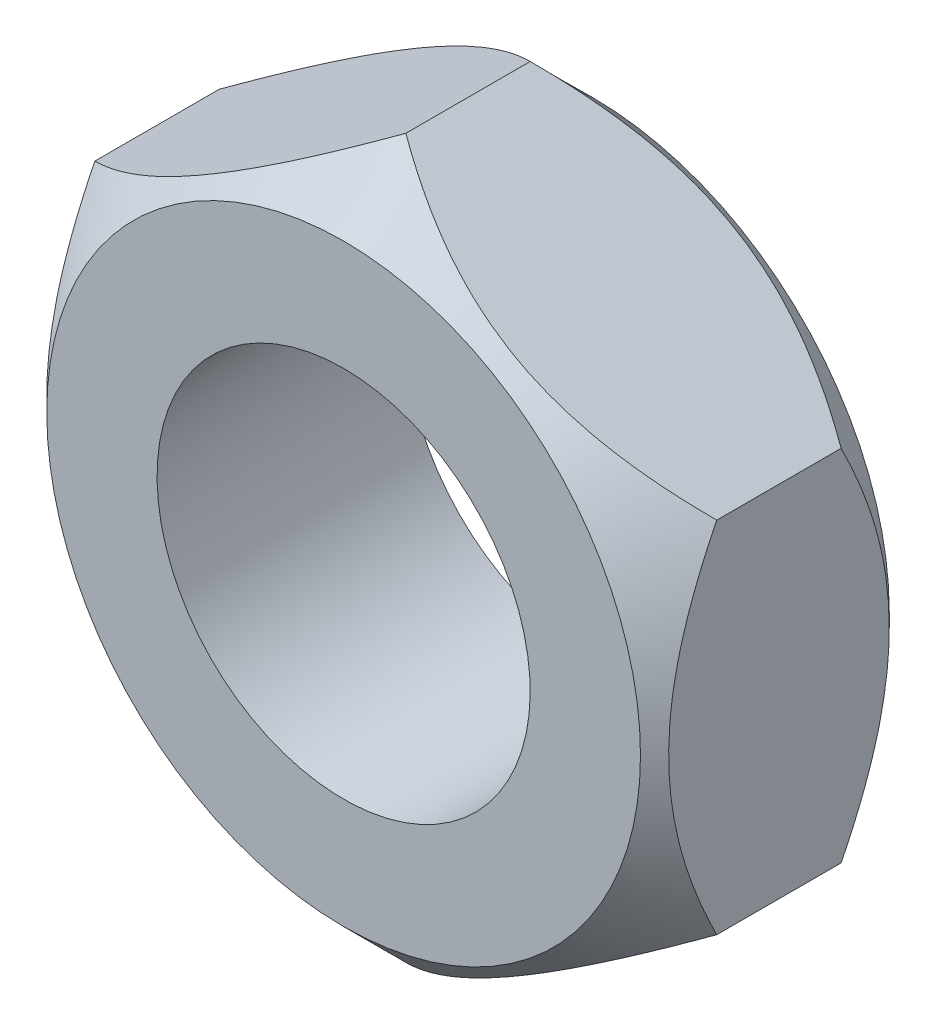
ISO-10303-21;
HEADER;
FILE_DESCRIPTION(('STEP AP214'),'2;1');
FILE_NAME('part.step','',(''),(''),'','','');
FILE_SCHEMA(('AUTOMOTIVE_DESIGN { 1 0 10303 214 1 1 1 1 }'));
ENDSEC;
DATA;
#1=APPLICATION_CONTEXT('core data for automotive mechanical design processes');
#2=APPLICATION_PROTOCOL_DEFINITION('international standard','automotive_design',2000,#1);
#3=PRODUCT_CONTEXT('',#1,'mechanical');
#4=PRODUCT('Part','Part','',(#3));
#5=PRODUCT_RELATED_PRODUCT_CATEGORY('part','',(#4));
#6=PRODUCT_DEFINITION_FORMATION('','',#4);
#7=PRODUCT_DEFINITION_CONTEXT('part definition',#1,'design');
#8=PRODUCT_DEFINITION('design','',#6,#7);
#9=PRODUCT_DEFINITION_SHAPE('','',#8);
#10=(LENGTH_UNIT() NAMED_UNIT(*) SI_UNIT(.MILLI.,.METRE.));
#11=(NAMED_UNIT(*) PLANE_ANGLE_UNIT() SI_UNIT($,.RADIAN.));
#12=(NAMED_UNIT(*) SI_UNIT($,.STERADIAN.) SOLID_ANGLE_UNIT());
#13=UNCERTAINTY_MEASURE_WITH_UNIT(LENGTH_MEASURE(1.E-05),#10,'distance_accuracy_value','');
#14=(GEOMETRIC_REPRESENTATION_CONTEXT(3) GLOBAL_UNCERTAINTY_ASSIGNED_CONTEXT((#13)) GLOBAL_UNIT_ASSIGNED_CONTEXT((#10,
#11,#12)) REPRESENTATION_CONTEXT('',''));
#15=CARTESIAN_POINT('',(0.,0.,0.));
#16=DIRECTION('',(0.,0.,1.));
#17=DIRECTION('',(1.,0.,0.));
#18=AXIS2_PLACEMENT_3D('',#15,#16,#17);
#19=CARTESIAN_POINT('',(89.089215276,333.149215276,-7.));
#20=DIRECTION('',(0.,0.,1.));
#21=DIRECTION('',(1.,0.,0.));
#22=AXIS2_PLACEMENT_3D('',#19,#20,#21);
#23=PLANE('',#22);
#24=CARTESIAN_POINT('',(93.92,337.98,-7.));
#25=DIRECTION('',(0.,0.,-1.));
#26=DIRECTION('',(0.,1.,0.));
#27=AXIS2_PLACEMENT_3D('',#24,#25,#26);
#28=CIRCLE('',#27,3.);
#29=CARTESIAN_POINT('',(93.92,340.98,-7.));
#30=VERTEX_POINT('',#29);
#31=EDGE_CURVE('E94',#30,#30,#28,.F.);
#32=ORIENTED_EDGE('',*,*,#31,.F.);
#33=EDGE_LOOP('',(#32));
#34=FACE_BOUND('',#33,.T.);
#35=CARTESIAN_POINT('',(93.92,337.98,-7.00000000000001));
#36=DIRECTION('',(0.,0.,-1.));
#37=DIRECTION('',(0.,1.,0.));
#38=AXIS2_PLACEMENT_3D('',#35,#36,#37);
#39=CIRCLE('',#38,4.77350269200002);
#40=CARTESIAN_POINT('',(93.92,342.753502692,-7.00000000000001));
#41=VERTEX_POINT('',#40);
#42=EDGE_CURVE('E102',#41,#41,#39,.F.);
#43=ORIENTED_EDGE('',*,*,#42,.T.);
#44=EDGE_LOOP('',(#43));
#45=FACE_BOUND('',#44,.T.);
#46=ADVANCED_FACE('F17',(#34,#45),#23,.T.);
#47=CARTESIAN_POINT('',(98.92,335.093248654,-10.827110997));
#48=DIRECTION('',(-0.500000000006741,0.866025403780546,0.));
#49=DIRECTION('',(-0.866025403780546,-0.500000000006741,0.));
#50=AXIS2_PLACEMENT_3D('',#47,#48,#49);
#51=PLANE('',#50);
#52=DIRECTION('',(0.,0.,1.));
#53=VECTOR('',#52,1.);
#54=CARTESIAN_POINT('',(98.92,335.093248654,-9.));
#55=LINE('',#54,#53);
#56=CARTESIAN_POINT('',(98.9200000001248,335.093248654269,-10.0000000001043));
#57=VERTEX_POINT('',#56);
#58=CARTESIAN_POINT('',(98.9200000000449,335.093248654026,-7.9999999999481));
#59=VERTEX_POINT('',#58);
#60=EDGE_CURVE('E78',#57,#59,#55,.T.);
#61=ORIENTED_EDGE('',*,*,#60,.T.);
#62=CARTESIAN_POINT('',(98.9200000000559,335.093248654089,-7.99999999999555));
#63=CARTESIAN_POINT('',(98.8340332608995,335.043615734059,-7.95037452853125));
#64=CARTESIAN_POINT('',(98.7474057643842,334.993601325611,-7.90227208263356));
#65=CARTESIAN_POINT('',(98.5726996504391,334.892734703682,-7.80957650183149));
#66=CARTESIAN_POINT('',(98.4846202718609,334.841882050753,-7.76498528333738));
#67=CARTESIAN_POINT('',(98.2171918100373,334.687482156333,-7.63679319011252));
#68=CARTESIAN_POINT('',(98.0355789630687,334.582627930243,-7.55932064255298));
#69=CARTESIAN_POINT('',(97.6693422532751,334.37118106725,-7.42665467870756));
#70=CARTESIAN_POINT('',(97.4848119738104,334.264642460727,-7.37112707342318));
#71=CARTESIAN_POINT('',(97.2049831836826,334.103083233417,-7.30689560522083));
#72=CARTESIAN_POINT('',(97.1112949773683,334.04899232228,-7.28867036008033));
#73=CARTESIAN_POINT('',(96.9231254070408,333.940352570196,-7.25898555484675));
#74=CARTESIAN_POINT('',(96.82864416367,333.885803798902,-7.24752498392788));
#75=CARTESIAN_POINT('',(96.5983981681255,333.752871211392,-7.22830918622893));
#76=CARTESIAN_POINT('',(96.4623853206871,333.674344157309,-7.22427791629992));
#77=CARTESIAN_POINT('',(96.190604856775,333.517431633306,-7.23104793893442));
#78=CARTESIAN_POINT('',(96.0548373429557,333.439046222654,-7.24185443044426));
#79=CARTESIAN_POINT('',(95.7845824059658,333.28301446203,-7.27766297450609));
#80=CARTESIAN_POINT('',(95.6500965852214,333.20536903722,-7.30268089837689));
#81=CARTESIAN_POINT('',(95.3834364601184,333.051412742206,-7.36555219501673));
#82=CARTESIAN_POINT('',(95.2512619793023,332.975101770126,-7.40340458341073));
#83=CARTESIAN_POINT('',(95.0166446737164,332.839645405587,-7.48127291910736));
#84=CARTESIAN_POINT('',(94.9136820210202,332.780199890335,-7.51923978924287));
#85=CARTESIAN_POINT('',(94.709604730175,332.662375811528,-7.60129088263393));
#86=CARTESIAN_POINT('',(94.6084901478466,332.603997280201,-7.64537529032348));
#87=CARTESIAN_POINT('',(94.4084275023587,332.488491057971,-7.73867347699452));
#88=CARTESIAN_POINT('',(94.3094737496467,332.431360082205,-7.78787112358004));
#89=CARTESIAN_POINT('',(94.1133982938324,332.318155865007,-7.89075008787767));
#90=CARTESIAN_POINT('',(94.016275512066,332.262082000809,-7.94442865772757));
#91=CARTESIAN_POINT('',(93.9200000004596,332.206497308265,-7.99999999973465));
#92=B_SPLINE_CURVE_WITH_KNOTS('',3,(#62,#63,#64,#65,#66,#67,#68,#69,#70,#71,#72,#73,#74,#75,#76,
#77,#78,#79,#80,#81,#82,#83,#84,#85,#86,#87,#88,#89,#90,#91),.UNSPECIFIED.,.F.,.F.,(4,2,2,2,2,2,
2,2,2,2,2,2,2,2,4),(0.,0.332918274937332,0.666017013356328,1.3358099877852,1.99496891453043,
2.32390206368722,2.65278604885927,3.12337124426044,3.59412136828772,4.06539826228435,
4.53663901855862,4.91088168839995,5.28513564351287,5.65824273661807,6.03112268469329),.UNSPECIFIED.);
#93=CARTESIAN_POINT('',(93.9200000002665,332.206497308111,-7.99999999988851));
#94=VERTEX_POINT('',#93);
#95=EDGE_CURVE('E21',#59,#94,#92,.T.);
#96=ORIENTED_EDGE('',*,*,#95,.T.);
#97=DIRECTION('',(0.,0.,-1.));
#98=VECTOR('',#97,1.);
#99=CARTESIAN_POINT('',(93.92,332.206497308,-9.));
#100=LINE('',#99,#98);
#101=CARTESIAN_POINT('',(93.919999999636,332.20649730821,-10.0000000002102));
#102=VERTEX_POINT('',#101);
#103=EDGE_CURVE('E112',#94,#102,#100,.T.);
#104=ORIENTED_EDGE('',*,*,#103,.T.);
#105=CARTESIAN_POINT('',(93.9199999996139,332.206497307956,-9.99999999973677));
#106=CARTESIAN_POINT('',(94.0059667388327,332.256130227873,-10.0496254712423));
#107=CARTESIAN_POINT('',(94.0925942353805,332.306144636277,-10.0977279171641));
#108=CARTESIAN_POINT('',(94.2673003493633,332.40701125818,-10.1904234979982));
#109=CARTESIAN_POINT('',(94.3553797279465,332.457863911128,-10.2350147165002));
#110=CARTESIAN_POINT('',(94.6228081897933,332.612263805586,-10.3632068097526));
#111=CARTESIAN_POINT('',(94.8044210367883,332.717118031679,-10.4406793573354));
#112=CARTESIAN_POINT('',(95.1706577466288,332.92856489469,-10.5733453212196));
#113=CARTESIAN_POINT('',(95.3551880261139,333.035103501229,-10.6288729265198));
#114=CARTESIAN_POINT('',(95.6350168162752,333.196662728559,-10.6931043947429));
#115=CARTESIAN_POINT('',(95.7287050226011,333.250753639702,-10.7113296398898));
#116=CARTESIAN_POINT('',(95.916874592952,333.359393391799,-10.7410144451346));
#117=CARTESIAN_POINT('',(96.0113558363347,333.413942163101,-10.7524750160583));
#118=CARTESIAN_POINT('',(96.2416018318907,333.546874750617,-10.7716908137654));
#119=CARTESIAN_POINT('',(96.3776146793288,333.6254018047,-10.7757220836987));
#120=CARTESIAN_POINT('',(96.6493951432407,333.782314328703,-10.7689520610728));
#121=CARTESIAN_POINT('',(96.78516265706,333.860699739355,-10.7581455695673));
#122=CARTESIAN_POINT('',(97.0554175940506,334.01673149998,-10.7223370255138));
#123=CARTESIAN_POINT('',(97.1899034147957,334.09437692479,-10.6973191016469));
#124=CARTESIAN_POINT('',(97.4565635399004,334.248333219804,-10.6344478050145));
#125=CARTESIAN_POINT('',(97.5887380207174,334.324644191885,-10.596595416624));
#126=CARTESIAN_POINT('',(97.8233553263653,334.46010055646,-10.518727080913));
#127=CARTESIAN_POINT('',(97.9263179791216,334.519546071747,-10.4807602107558));
#128=CARTESIAN_POINT('',(98.1303952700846,334.637370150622,-10.3987091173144));
#129=CARTESIAN_POINT('',(98.2315098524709,334.695748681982,-10.3546247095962));
#130=CARTESIAN_POINT('',(98.4315724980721,334.811254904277,-10.2613265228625));
#131=CARTESIAN_POINT('',(98.5305262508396,334.868385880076,-10.212128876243));
#132=CARTESIAN_POINT('',(98.7266017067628,334.981590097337,-10.1092499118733));
#133=CARTESIAN_POINT('',(98.8237244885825,335.037663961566,-10.0555713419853));
#134=CARTESIAN_POINT('',(98.9200000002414,335.093248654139,-9.99999999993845));
#135=B_SPLINE_CURVE_WITH_KNOTS('',3,(#105,#106,#107,#108,#109,#110,#111,#112,#113,#114,#115,
#116,#117,#118,#119,#120,#121,#122,#123,#124,#125,#126,#127,#128,#129,#130,#131,#132,#133,#134),
.UNSPECIFIED.,.F.,.F.,(4,2,2,2,2,2,2,2,2,2,2,2,2,2,4),(0.,0.332918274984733,0.666017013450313,
1.33580998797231,1.99496891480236,2.32390206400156,2.65278604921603,3.12337124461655,
3.59412136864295,4.06539826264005,4.53663901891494,4.91088168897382,5.28513564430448,
5.65824273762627,6.03112268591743),.UNSPECIFIED.);
#136=EDGE_CURVE('E92',#102,#57,#135,.T.);
#137=ORIENTED_EDGE('',*,*,#136,.T.);
#138=EDGE_LOOP('',(#61,#96,#104,#137));
#139=FACE_BOUND('',#138,.T.);
#140=ADVANCED_FACE('F89',(#139),#51,.F.);
#141=CARTESIAN_POINT('',(93.92,337.98,-7.));
#142=DIRECTION('',(0.,0.,-1.));
#143=DIRECTION('',(0.,1.,0.));
#144=AXIS2_PLACEMENT_3D('',#141,#142,#143);
#145=CONICAL_SURFACE('',#144,4.77350269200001,0.785398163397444);
#146=ORIENTED_EDGE('',*,*,#42,.F.);
#147=EDGE_LOOP('',(#146));
#148=FACE_BOUND('',#147,.T.);
#149=CARTESIAN_POINT('',(93.9199999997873,343.753502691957,-7.9999999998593));
#150=CARTESIAN_POINT('',(93.8340332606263,343.70386977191,-7.95037452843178));
#151=CARTESIAN_POINT('',(93.7474057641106,343.653855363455,-7.90227208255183));
#152=CARTESIAN_POINT('',(93.5726996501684,343.552988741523,-7.80957650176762));
#153=CARTESIAN_POINT('',(93.4846202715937,343.502136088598,-7.76498528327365));
#154=CARTESIAN_POINT('',(93.2171918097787,343.347736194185,-7.63679319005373));
#155=CARTESIAN_POINT('',(93.0355789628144,343.242881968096,-7.55932064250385));
#156=CARTESIAN_POINT('',(92.6693422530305,343.031435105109,-7.4266546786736));
#157=CARTESIAN_POINT('',(92.4848119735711,342.924896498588,-7.37112707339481));
#158=CARTESIAN_POINT('',(92.2049831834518,342.763337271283,-7.30689560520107));
#159=CARTESIAN_POINT('',(92.1112949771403,342.709246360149,-7.28867036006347));
#160=CARTESIAN_POINT('',(91.9231254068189,342.600606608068,-7.25898555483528));
#161=CARTESIAN_POINT('',(91.8286441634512,342.546057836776,-7.2475249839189));
#162=CARTESIAN_POINT('',(91.5983981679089,342.413125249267,-7.22830918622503));
#163=CARTESIAN_POINT('',(91.4623853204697,342.334598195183,-7.22427791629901));
#164=CARTESIAN_POINT('',(91.1906048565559,342.177685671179,-7.2310479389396));
#165=CARTESIAN_POINT('',(91.0548373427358,342.099300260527,-7.24185443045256));
#166=CARTESIAN_POINT('',(90.7845824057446,341.943268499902,-7.27766297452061));
#167=CARTESIAN_POINT('',(90.6500965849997,341.865623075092,-7.30268089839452));
#168=CARTESIAN_POINT('',(90.3834364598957,341.711666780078,-7.3655521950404));
#169=CARTESIAN_POINT('',(90.2512619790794,341.635355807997,-7.40340458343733));
#170=CARTESIAN_POINT('',(90.0166446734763,341.499899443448,-7.48127291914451));
#171=CARTESIAN_POINT('',(89.9136820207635,341.440453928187,-7.5192397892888));
#172=CARTESIAN_POINT('',(89.7096047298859,341.322629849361,-7.6012908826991));
#173=CARTESIAN_POINT('',(89.6084901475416,341.264251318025,-7.64537529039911));
#174=CARTESIAN_POINT('',(89.4084275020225,341.148745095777,-7.73867347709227));
#175=CARTESIAN_POINT('',(89.3094737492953,341.091614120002,-7.78787112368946));
#176=CARTESIAN_POINT('',(89.113398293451,340.978409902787,-7.89075008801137));
#177=CARTESIAN_POINT('',(89.0162755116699,340.92233603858,-7.94442865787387));
#178=CARTESIAN_POINT('',(88.920000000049,340.866751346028,-7.99999999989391));
#179=B_SPLINE_CURVE_WITH_KNOTS('',3,(#149,#150,#151,#152,#153,#154,#155,#156,#157,#158,#159,
#160,#161,#162,#163,#164,#165,#166,#167,#168,#169,#170,#171,#172,#173,#174,#175,#176,#177,#178),
.UNSPECIFIED.,.F.,.F.,(4,2,2,2,2,2,2,2,2,2,2,2,2,2,4),(0.,0.332918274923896,0.666017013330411,
1.33580998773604,1.9949689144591,2.32390206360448,2.65278604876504,3.12337124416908,
3.59412136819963,4.06539826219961,4.53663901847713,4.91088168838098,5.28513564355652,
5.6582427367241,6.03112268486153),.UNSPECIFIED.);
#180=CARTESIAN_POINT('',(93.9200000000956,343.753502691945,-7.99999999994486));
#181=VERTEX_POINT('',#180);
#182=CARTESIAN_POINT('',(88.9200000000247,340.866751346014,-7.99999999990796));
#183=VERTEX_POINT('',#182);
#184=EDGE_CURVE('E193',#181,#183,#179,.T.);
#185=ORIENTED_EDGE('',*,*,#184,.T.);
#186=CARTESIAN_POINT('',(88.9199999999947,340.866751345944,-7.99999999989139));
#187=CARTESIAN_POINT('',(88.9199999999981,340.768134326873,-7.95069857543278));
#188=CARTESIAN_POINT('',(88.9199999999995,340.66876378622,-7.90290055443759));
#189=CARTESIAN_POINT('',(88.9200000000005,340.468369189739,-7.81076481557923));
#190=CARTESIAN_POINT('',(88.9200000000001,340.367344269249,-7.76642898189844));
#191=CARTESIAN_POINT('',(88.9199999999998,340.060508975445,-7.63886641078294));
#192=CARTESIAN_POINT('',(88.9200000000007,339.852117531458,-7.56168720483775));
#193=CARTESIAN_POINT('',(88.9199999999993,339.429264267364,-7.42845956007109));
#194=CARTESIAN_POINT('',(88.919999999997,339.214825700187,-7.37233960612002));
#195=CARTESIAN_POINT('',(88.9200000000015,338.889670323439,-7.30746295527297));
#196=CARTESIAN_POINT('',(88.9200000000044,338.780838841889,-7.28906547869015));
#197=CARTESIAN_POINT('',(88.9199999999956,338.562250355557,-7.2591228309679));
#198=CARTESIAN_POINT('',(88.9199999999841,338.452493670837,-7.24757538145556));
#199=CARTESIAN_POINT('',(88.9200000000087,338.282160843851,-7.23525702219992));
#200=CARTESIAN_POINT('',(88.9200000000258,338.22175700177,-7.23197445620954));
#201=CARTESIAN_POINT('',(88.9199999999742,338.100904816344,-7.22759417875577));
#202=CARTESIAN_POINT('',(88.9199999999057,338.040456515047,-7.22649528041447));
#203=CARTESIAN_POINT('',(88.9199999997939,337.828266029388,-7.22650239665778));
#204=CARTESIAN_POINT('',(88.9199999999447,337.676480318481,-7.23344234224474));
#205=CARTESIAN_POINT('',(88.9200000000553,337.374072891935,-7.26082178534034));
#206=CARTESIAN_POINT('',(88.9200000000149,337.223452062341,-7.28127069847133));
#207=CARTESIAN_POINT('',(88.9199999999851,336.923754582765,-7.33470670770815));
#208=CARTESIAN_POINT('',(88.919999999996,336.774688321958,-7.36775146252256));
#209=CARTESIAN_POINT('',(88.920000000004,336.479421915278,-7.44486859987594));
#210=CARTESIAN_POINT('',(88.9200000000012,336.333222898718,-7.48894523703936));
#211=CARTESIAN_POINT('',(88.9199999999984,335.999831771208,-7.60138894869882));
#212=CARTESIAN_POINT('',(88.9199999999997,335.813756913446,-7.67306329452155));
#213=CARTESIAN_POINT('',(88.9200000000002,335.539596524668,-7.78966277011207));
#214=CARTESIAN_POINT('',(88.9200000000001,335.449432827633,-7.82984151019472));
#215=CARTESIAN_POINT('',(88.9199999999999,335.270396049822,-7.91294466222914));
#216=CARTESIAN_POINT('',(88.9199999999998,335.181522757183,-7.95586861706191));
#217=CARTESIAN_POINT('',(88.92,335.093248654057,-7.99999999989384));
#218=B_SPLINE_CURVE_WITH_KNOTS('',3,(#186,#187,#188,#189,#190,#191,#192,#193,#194,#195,#196,
#197,#198,#199,#200,#201,#202,#203,#204,#205,#206,#207,#208,#209,#210,#211,#212,#213,#214,#215,
#216,#217),.UNSPECIFIED.,.F.,.F.,(4,2,2,2,2,2,2,2,2,2,2,2,2,2,2,4),(0.,0.330743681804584,
0.661666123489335,1.32747457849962,1.99100110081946,2.32194787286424,2.65278450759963,
2.83422741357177,3.01557167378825,3.47071012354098,3.9261661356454,4.38373257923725,
4.84147576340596,5.43902020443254,5.73511925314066,6.031169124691),.UNSPECIFIED.);
#219=CARTESIAN_POINT('',(88.9200000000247,335.093248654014,-7.99999999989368));
#220=VERTEX_POINT('',#219);
#221=EDGE_CURVE('E201',#183,#220,#218,.T.);
#222=ORIENTED_EDGE('',*,*,#221,.T.);
#223=CARTESIAN_POINT('',(88.9200000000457,335.093248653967,-7.99999999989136));
#224=CARTESIAN_POINT('',(89.0059667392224,335.043615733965,-7.95037452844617));
#225=CARTESIAN_POINT('',(89.0925942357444,334.99360132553,-7.90227208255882));
#226=CARTESIAN_POINT('',(89.2673003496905,334.892734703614,-7.80957650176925));
#227=CARTESIAN_POINT('',(89.355379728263,334.841882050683,-7.76498528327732));
#228=CARTESIAN_POINT('',(89.6228081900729,334.687482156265,-7.63679319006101));
#229=CARTESIAN_POINT('',(89.8044210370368,334.582627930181,-7.55932064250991));
#230=CARTESIAN_POINT('',(90.1706577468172,334.371181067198,-7.42665467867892));
#231=CARTESIAN_POINT('',(90.3551880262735,334.264642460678,-7.37112707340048));
#232=CARTESIAN_POINT('',(90.6350168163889,334.103083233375,-7.30689560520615));
#233=CARTESIAN_POINT('',(90.7287050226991,334.048992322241,-7.28867036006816));
#234=CARTESIAN_POINT('',(90.916874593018,333.940352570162,-7.25898555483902));
#235=CARTESIAN_POINT('',(91.0113558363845,333.88580379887,-7.24752498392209));
#236=CARTESIAN_POINT('',(91.2416018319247,333.752871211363,-7.22830918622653));
#237=CARTESIAN_POINT('',(91.3776146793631,333.67434415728,-7.22427791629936));
#238=CARTESIAN_POINT('',(91.6493951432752,333.517431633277,-7.23104793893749));
#239=CARTESIAN_POINT('',(91.7851626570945,333.439046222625,-7.24185443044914));
#240=CARTESIAN_POINT('',(92.0554175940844,333.283014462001,-7.27766297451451));
#241=CARTESIAN_POINT('',(92.1899034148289,333.205369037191,-7.30268089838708));
#242=CARTESIAN_POINT('',(92.4565635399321,333.051412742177,-7.36555219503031));
#243=CARTESIAN_POINT('',(92.5887380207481,332.975101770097,-7.40340458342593));
#244=CARTESIAN_POINT('',(92.8233553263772,332.839645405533,-7.48127291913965));
#245=CARTESIAN_POINT('',(92.9263179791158,332.780199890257,-7.51923978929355));
#246=CARTESIAN_POINT('',(93.1303952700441,332.662375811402,-7.60129088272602));
#247=CARTESIAN_POINT('',(93.2315098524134,332.603997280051,-7.64537529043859));
#248=CARTESIAN_POINT('',(93.4315724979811,332.488491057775,-7.73867347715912));
#249=CARTESIAN_POINT('',(93.5305262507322,332.431360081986,-7.7878711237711));
#250=CARTESIAN_POINT('',(93.7266017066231,332.318155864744,-7.89075008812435));
#251=CARTESIAN_POINT('',(93.8237244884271,332.262082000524,-7.94442865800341));
#252=CARTESIAN_POINT('',(93.9200000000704,332.206497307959,-8.00000000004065));
#253=B_SPLINE_CURVE_WITH_KNOTS('',3,(#223,#224,#225,#226,#227,#228,#229,#230,#231,#232,#233,
#234,#235,#236,#237,#238,#239,#240,#241,#242,#243,#244,#245,#246,#247,#248,#249,#250,#251,#252),
.UNSPECIFIED.,.F.,.F.,(4,2,2,2,2,2,2,2,2,2,2,2,2,2,4),(0.,0.332918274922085,0.666017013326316,
1.33580998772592,1.99496891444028,2.32390206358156,2.65278604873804,3.12337124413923,
3.59412136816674,4.06539826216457,4.53663901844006,4.91088168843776,5.28513564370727,
5.65824273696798,6.03112268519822),.UNSPECIFIED.);
#254=EDGE_CURVE('E99',#220,#94,#253,.T.);
#255=ORIENTED_EDGE('',*,*,#254,.T.);
#256=ORIENTED_EDGE('',*,*,#95,.F.);
#257=CARTESIAN_POINT('',(98.92,335.09324865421,-7.99999999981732));
#258=CARTESIAN_POINT('',(98.9199999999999,335.191865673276,-7.9506985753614));
#259=CARTESIAN_POINT('',(98.92,335.291236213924,-7.90290055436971));
#260=CARTESIAN_POINT('',(98.92,335.491630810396,-7.81076481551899));
#261=CARTESIAN_POINT('',(98.9200000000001,335.592655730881,-7.76642898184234));
#262=CARTESIAN_POINT('',(98.9199999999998,335.89949102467,-7.63886641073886));
#263=CARTESIAN_POINT('',(98.9199999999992,336.107882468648,-7.56168720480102));
#264=CARTESIAN_POINT('',(98.9200000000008,336.53073573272,-7.4284595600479));
#265=CARTESIAN_POINT('',(98.9200000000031,336.745174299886,-7.37233960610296));
#266=CARTESIAN_POINT('',(98.9199999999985,337.070329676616,-7.30746295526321));
#267=CARTESIAN_POINT('',(98.9199999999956,337.17916115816,-7.2890654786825));
#268=CARTESIAN_POINT('',(98.9200000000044,337.39774964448,-7.25912283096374));
#269=CARTESIAN_POINT('',(98.920000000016,337.507506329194,-7.24757538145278));
#270=CARTESIAN_POINT('',(98.9199999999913,337.677839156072,-7.23525702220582));
#271=CARTESIAN_POINT('',(98.9199999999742,337.73824299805,-7.23197445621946));
#272=CARTESIAN_POINT('',(98.9200000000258,337.859095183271,-7.22759417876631));
#273=CARTESIAN_POINT('',(98.9200000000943,337.919543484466,-7.22649528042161));
#274=CARTESIAN_POINT('',(98.9200000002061,338.131733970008,-7.22650239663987));
#275=CARTESIAN_POINT('',(98.9200000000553,338.283519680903,-7.23344234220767));
#276=CARTESIAN_POINT('',(98.9199999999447,338.585927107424,-7.26082178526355));
#277=CARTESIAN_POINT('',(98.9199999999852,338.736547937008,-7.281270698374));
#278=CARTESIAN_POINT('',(98.9200000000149,339.036245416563,-7.33470670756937));
#279=CARTESIAN_POINT('',(98.920000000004,339.18531167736,-7.36775146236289));
#280=CARTESIAN_POINT('',(98.919999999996,339.480578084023,-7.44486859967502));
#281=CARTESIAN_POINT('',(98.9199999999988,339.626777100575,-7.48894523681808));
#282=CARTESIAN_POINT('',(98.9200000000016,339.960168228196,-7.60138894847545));
#283=CARTESIAN_POINT('',(98.9200000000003,340.146243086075,-7.67306329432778));
#284=CARTESIAN_POINT('',(98.9199999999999,340.420403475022,-7.78966276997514));
#285=CARTESIAN_POINT('',(98.9199999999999,340.510567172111,-7.82984151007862));
#286=CARTESIAN_POINT('',(98.9200000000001,340.68960395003,-7.91294466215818));
#287=CARTESIAN_POINT('',(98.9200000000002,340.778477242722,-7.95586861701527));
#288=CARTESIAN_POINT('',(98.92,340.866751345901,-7.99999999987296));
#289=B_SPLINE_CURVE_WITH_KNOTS('',3,(#257,#258,#259,#260,#261,#262,#263,#264,#265,#266,#267,
#268,#269,#270,#271,#272,#273,#274,#275,#276,#277,#278,#279,#280,#281,#282,#283,#284,#285,#286,
#287,#288),.UNSPECIFIED.,.F.,.F.,(4,2,2,2,2,2,2,2,2,2,2,2,2,2,2,4),(0.,0.330743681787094,
0.661666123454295,1.32747457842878,1.99100110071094,2.32194787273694,2.65278450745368,
2.83422741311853,3.01557167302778,3.47071012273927,3.92616613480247,4.38373257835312,
4.84147576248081,5.4390202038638,5.73511925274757,6.03116912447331),.UNSPECIFIED.);
#290=CARTESIAN_POINT('',(98.92,340.866751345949,-7.99999999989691));
#291=VERTEX_POINT('',#290);
#292=EDGE_CURVE('E75',#59,#291,#289,.T.);
#293=ORIENTED_EDGE('',*,*,#292,.T.);
#294=CARTESIAN_POINT('',(98.919999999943,340.866751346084,-7.99999999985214));
#295=CARTESIAN_POINT('',(98.8340332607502,340.916384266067,-7.95037452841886));
#296=CARTESIAN_POINT('',(98.7474057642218,340.966398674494,-7.90227208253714));
#297=CARTESIAN_POINT('',(98.5726996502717,341.067265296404,-7.809576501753));
#298=CARTESIAN_POINT('',(98.4846202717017,341.118117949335,-7.76498528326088));
#299=CARTESIAN_POINT('',(98.2171918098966,341.272517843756,-7.63679319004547));
#300=CARTESIAN_POINT('',(98.0355789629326,341.377372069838,-7.55932064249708));
#301=CARTESIAN_POINT('',(97.6693422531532,341.588818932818,-7.42665467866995));
#302=CARTESIAN_POINT('',(97.4848119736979,341.695357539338,-7.37112707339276));
#303=CARTESIAN_POINT('',(97.2049831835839,341.85691676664,-7.30689560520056));
#304=CARTESIAN_POINT('',(97.1112949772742,341.911007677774,-7.28867036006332));
#305=CARTESIAN_POINT('',(96.9231254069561,342.019647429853,-7.25898555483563));
#306=CARTESIAN_POINT('',(96.8286441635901,342.074196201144,-7.24752498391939));
#307=CARTESIAN_POINT('',(96.5983981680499,342.207128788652,-7.22830918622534));
#308=CARTESIAN_POINT('',(96.462385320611,342.285655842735,-7.2242779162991));
#309=CARTESIAN_POINT('',(96.1906048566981,342.442568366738,-7.23104793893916));
#310=CARTESIAN_POINT('',(96.0548373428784,342.520953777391,-7.24185443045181));
#311=CARTESIAN_POINT('',(95.7845824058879,342.676985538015,-7.27766297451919));
#312=CARTESIAN_POINT('',(95.6500965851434,342.754630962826,-7.30268089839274));
#313=CARTESIAN_POINT('',(95.38343646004,342.908587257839,-7.36555219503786));
#314=CARTESIAN_POINT('',(95.251261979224,342.984898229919,-7.40340458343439));
#315=CARTESIAN_POINT('',(95.0166446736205,343.120354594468,-7.48127291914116));
#316=CARTESIAN_POINT('',(94.913682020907,343.17980010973,-7.5192397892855));
#317=CARTESIAN_POINT('',(94.7096047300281,343.297624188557,-7.60129088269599));
#318=CARTESIAN_POINT('',(94.6084901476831,343.356002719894,-7.64537529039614));
#319=CARTESIAN_POINT('',(94.4084275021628,343.471508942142,-7.73867347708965));
#320=CARTESIAN_POINT('',(94.3094737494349,343.528639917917,-7.78787112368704));
#321=CARTESIAN_POINT('',(94.1133982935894,343.641844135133,-7.89075008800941));
#322=CARTESIAN_POINT('',(94.0162755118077,343.69791799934,-7.94442865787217));
#323=CARTESIAN_POINT('',(93.9200000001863,343.753502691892,-7.99999999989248));
#324=B_SPLINE_CURVE_WITH_KNOTS('',3,(#294,#295,#296,#297,#298,#299,#300,#301,#302,#303,#304,
#305,#306,#307,#308,#309,#310,#311,#312,#313,#314,#315,#316,#317,#318,#319,#320,#321,#322,#323),
.UNSPECIFIED.,.F.,.F.,(4,2,2,2,2,2,2,2,2,2,2,2,2,2,4),(0.,0.332918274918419,0.666017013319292,
1.33580998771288,1.99496891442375,2.32390206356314,2.6527860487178,3.12337124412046,
3.59412136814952,4.06539826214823,4.53663901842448,4.91088168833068,5.28513564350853,
5.65824273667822,6.03112268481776),.UNSPECIFIED.);
#325=EDGE_CURVE('E155',#291,#181,#324,.T.);
#326=ORIENTED_EDGE('',*,*,#325,.T.);
#327=EDGE_LOOP('',(#185,#222,#255,#256,#293,#326));
#328=FACE_BOUND('',#327,.T.);
#329=ADVANCED_FACE('F97',(#148,#328),#145,.T.);
#330=CARTESIAN_POINT('',(93.92,332.206497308,-10.827110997));
#331=DIRECTION('',(0.500000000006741,0.866025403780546,0.));
#332=DIRECTION('',(-0.866025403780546,0.500000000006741,0.));
#333=AXIS2_PLACEMENT_3D('',#330,#331,#332);
#334=PLANE('',#333);
#335=ORIENTED_EDGE('',*,*,#103,.F.);
#336=ORIENTED_EDGE('',*,*,#254,.F.);
#337=DIRECTION('',(0.,0.,-1.));
#338=VECTOR('',#337,1.);
#339=CARTESIAN_POINT('',(88.92,335.093248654,-9.));
#340=LINE('',#339,#338);
#341=CARTESIAN_POINT('',(88.9199999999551,335.093248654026,-10.0000000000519));
#342=VERTEX_POINT('',#341);
#343=EDGE_CURVE('E206',#220,#342,#340,.T.);
#344=ORIENTED_EDGE('',*,*,#343,.T.);
#345=CARTESIAN_POINT('',(88.9199999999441,335.093248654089,-10.0000000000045));
#346=CARTESIAN_POINT('',(89.0059667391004,335.043615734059,-10.0496254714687));
#347=CARTESIAN_POINT('',(89.0925942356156,334.993601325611,-10.0977279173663));
#348=CARTESIAN_POINT('',(89.2673003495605,334.892734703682,-10.1904234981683));
#349=CARTESIAN_POINT('',(89.3553797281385,334.841882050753,-10.2350147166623));
#350=CARTESIAN_POINT('',(89.6228081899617,334.687482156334,-10.363206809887));
#351=CARTESIAN_POINT('',(89.8044210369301,334.582627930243,-10.4406793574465));
#352=CARTESIAN_POINT('',(90.1706577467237,334.371181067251,-10.573345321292));
#353=CARTESIAN_POINT('',(90.3551880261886,334.264642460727,-10.6288729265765));
#354=CARTESIAN_POINT('',(90.6350168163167,334.103083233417,-10.693104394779));
#355=CARTESIAN_POINT('',(90.7287050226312,334.048992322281,-10.7113296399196));
#356=CARTESIAN_POINT('',(90.9168745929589,333.940352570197,-10.7410144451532));
#357=CARTESIAN_POINT('',(91.0113558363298,333.885803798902,-10.7524750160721));
#358=CARTESIAN_POINT('',(91.2416018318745,333.752871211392,-10.7716908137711));
#359=CARTESIAN_POINT('',(91.377614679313,333.674344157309,-10.7757220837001));
#360=CARTESIAN_POINT('',(91.6493951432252,333.517431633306,-10.7689520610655));
#361=CARTESIAN_POINT('',(91.7851626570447,333.439046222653,-10.7581455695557));
#362=CARTESIAN_POINT('',(92.0554175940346,333.28301446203,-10.7223370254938));
#363=CARTESIAN_POINT('',(92.1899034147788,333.205369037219,-10.697319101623));
#364=CARTESIAN_POINT('',(92.4565635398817,333.051412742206,-10.6344478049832));
#365=CARTESIAN_POINT('',(92.5887380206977,332.975101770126,-10.5965954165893));
#366=CARTESIAN_POINT('',(92.8233553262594,332.839645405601,-10.5187270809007));
#367=CARTESIAN_POINT('',(92.9263179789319,332.780199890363,-10.4807602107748));
#368=CARTESIAN_POINT('',(93.1303952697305,332.662375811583,-10.3987091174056));
#369=CARTESIAN_POINT('',(93.231509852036,332.603997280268,-10.3546247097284));
#370=CARTESIAN_POINT('',(93.4315724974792,332.488491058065,-10.2613265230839));
#371=CARTESIAN_POINT('',(93.5305262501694,332.431360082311,-10.2121288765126));
#372=CARTESIAN_POINT('',(93.7266017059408,332.318155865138,-10.1092499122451));
#373=CARTESIAN_POINT('',(93.8237244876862,332.262082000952,-10.055571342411));
#374=CARTESIAN_POINT('',(93.9199999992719,332.20649730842,-10.0000000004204));
#375=B_SPLINE_CURVE_WITH_KNOTS('',3,(#345,#346,#347,#348,#349,#350,#351,#352,#353,#354,#355,
#356,#357,#358,#359,#360,#361,#362,#363,#364,#365,#366,#367,#368,#369,#370,#371,#372,#373,#374),
.UNSPECIFIED.,.F.,.F.,(4,2,2,2,2,2,2,2,2,2,2,2,2,2,4),(0.,0.332918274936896,0.66601701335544,
1.33580998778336,1.99496891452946,2.32390206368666,2.65278604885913,3.12337124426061,
3.59412136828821,4.06539826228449,4.53663901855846,4.91088168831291,5.28513564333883,
5.65824273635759,6.03112268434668),.UNSPECIFIED.);
#376=EDGE_CURVE('E119',#342,#102,#375,.T.);
#377=ORIENTED_EDGE('',*,*,#376,.T.);
#378=EDGE_LOOP('',(#335,#336,#344,#377));
#379=FACE_BOUND('',#378,.T.);
#380=ADVANCED_FACE('F127',(#379),#334,.F.);
#381=CARTESIAN_POINT('',(93.92,337.98,-7.));
#382=DIRECTION('',(0.,0.,-1.));
#383=DIRECTION('',(0.,1.,0.));
#384=AXIS2_PLACEMENT_3D('',#381,#382,#383);
#385=CYLINDRICAL_SURFACE('',#384,3.);
#386=CARTESIAN_POINT('',(93.92,337.98,-11.));
#387=DIRECTION('',(0.,0.,-1.));
#388=DIRECTION('',(0.,1.,0.));
#389=AXIS2_PLACEMENT_3D('',#386,#387,#388);
#390=CIRCLE('',#389,3.);
#391=CARTESIAN_POINT('',(93.92,340.98,-11.));
#392=VERTEX_POINT('',#391);
#393=EDGE_CURVE('E207',#392,#392,#390,.T.);
#394=ORIENTED_EDGE('',*,*,#393,.T.);
#395=EDGE_LOOP('',(#394));
#396=FACE_BOUND('',#395,.T.);
#397=ORIENTED_EDGE('',*,*,#31,.T.);
#398=EDGE_LOOP('',(#397));
#399=FACE_BOUND('',#398,.T.);
#400=ADVANCED_FACE('F131',(#396,#399),#385,.F.);
#401=CARTESIAN_POINT('',(98.92,335.093248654,-10.804758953));
#402=DIRECTION('',(-1.,0.,0.));
#403=DIRECTION('',(0.,0.,1.));
#404=AXIS2_PLACEMENT_3D('',#401,#402,#403);
#405=PLANE('',#404);
#406=DIRECTION('',(0.,0.,1.));
#407=VECTOR('',#406,1.);
#408=CARTESIAN_POINT('',(98.92,340.866751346,-9.));
#409=LINE('',#408,#407);
#410=CARTESIAN_POINT('',(98.92,340.866751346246,-9.99999999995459));
#411=VERTEX_POINT('',#410);
#412=EDGE_CURVE('E80',#411,#291,#409,.T.);
#413=ORIENTED_EDGE('',*,*,#412,.T.);
#414=ORIENTED_EDGE('',*,*,#292,.F.);
#415=ORIENTED_EDGE('',*,*,#60,.F.);
#416=CARTESIAN_POINT('',(98.92,335.093248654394,-10.0000000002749));
#417=CARTESIAN_POINT('',(98.92,335.191865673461,-10.0493014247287));
#418=CARTESIAN_POINT('',(98.92,335.291236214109,-10.0970994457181));
#419=CARTESIAN_POINT('',(98.92,335.491630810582,-10.189235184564));
#420=CARTESIAN_POINT('',(98.92,335.592655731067,-10.233571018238));
#421=CARTESIAN_POINT('',(98.92,335.899491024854,-10.3611335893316));
#422=CARTESIAN_POINT('',(98.92,336.107882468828,-10.4383127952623));
#423=CARTESIAN_POINT('',(98.92,336.530735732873,-10.5715404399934));
#424=CARTESIAN_POINT('',(98.92,336.745174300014,-10.6276603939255));
#425=CARTESIAN_POINT('',(98.92,337.070329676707,-10.6925370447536));
#426=CARTESIAN_POINT('',(98.92,337.17916115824,-10.7109345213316));
#427=CARTESIAN_POINT('',(98.92,337.397749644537,-10.7408771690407));
#428=CARTESIAN_POINT('',(98.92,337.507506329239,-10.7524246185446));
#429=CARTESIAN_POINT('',(98.92,337.677839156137,-10.7647429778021));
#430=CARTESIAN_POINT('',(98.92,337.738242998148,-10.7680255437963));
#431=CARTESIAN_POINT('',(98.92,337.859095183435,-10.7724058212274));
#432=CARTESIAN_POINT('',(98.92,337.919543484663,-10.7735047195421));
#433=CARTESIAN_POINT('',(98.92,338.131733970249,-10.7734976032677));
#434=CARTESIAN_POINT('',(98.92,338.283519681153,-10.7665576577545));
#435=CARTESIAN_POINT('',(98.92,338.585927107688,-10.7391782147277));
#436=CARTESIAN_POINT('',(98.92,338.736547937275,-10.7187293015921));
#437=CARTESIAN_POINT('',(98.92,339.036245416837,-10.6652932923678));
#438=CARTESIAN_POINT('',(98.92,339.185311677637,-10.6322485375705));
#439=CARTESIAN_POINT('',(98.92,339.480578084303,-10.555131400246));
#440=CARTESIAN_POINT('',(98.92,339.626777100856,-10.5110547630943));
#441=CARTESIAN_POINT('',(98.92,339.960168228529,-10.3986110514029));
#442=CARTESIAN_POINT('',(98.92,340.146243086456,-10.3269367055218));
#443=CARTESIAN_POINT('',(98.92,340.420403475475,-10.2103372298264));
#444=CARTESIAN_POINT('',(98.92,340.51056717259,-10.1701584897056));
#445=CARTESIAN_POINT('',(98.92,340.689603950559,-10.0870553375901));
#446=CARTESIAN_POINT('',(98.92,340.778477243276,-10.0441313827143));
#447=CARTESIAN_POINT('',(98.92,340.86675134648,-9.99999999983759));
#448=B_SPLINE_CURVE_WITH_KNOTS('',3,(#416,#417,#418,#419,#420,#421,#422,#423,#424,#425,#426,
#427,#428,#429,#430,#431,#432,#433,#434,#435,#436,#437,#438,#439,#440,#441,#442,#443,#444,#445,
#446,#447),.UNSPECIFIED.,.F.,.F.,(4,2,2,2,2,2,2,2,2,2,2,2,2,2,2,4),(0.,0.330743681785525,
0.661666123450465,1.32747457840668,1.99100110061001,2.32194787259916,2.65278450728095,
2.83422741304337,3.01557167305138,3.47071012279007,3.92616613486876,4.38373257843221,
4.84147576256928,5.43902020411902,5.73511925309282,6.03116912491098),.UNSPECIFIED.);
#449=EDGE_CURVE('E144',#57,#411,#448,.T.);
#450=ORIENTED_EDGE('',*,*,#449,.T.);
#451=EDGE_LOOP('',(#413,#414,#415,#450));
#452=FACE_BOUND('',#451,.T.);
#453=ADVANCED_FACE('F77',(#452),#405,.F.);
#454=CARTESIAN_POINT('',(93.92,343.753502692,-10.827110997));
#455=DIRECTION('',(-0.500000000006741,-0.866025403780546,0.));
#456=DIRECTION('',(0.866025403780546,-0.500000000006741,0.));
#457=AXIS2_PLACEMENT_3D('',#454,#455,#456);
#458=PLANE('',#457);
#459=DIRECTION('',(0.,0.,1.));
#460=VECTOR('',#459,1.);
#461=CARTESIAN_POINT('',(93.92,343.753502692,-9.));
#462=LINE('',#461,#460);
#463=CARTESIAN_POINT('',(93.9199999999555,343.753502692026,-9.99999999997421));
#464=VERTEX_POINT('',#463);
#465=EDGE_CURVE('E200',#464,#181,#462,.T.);
#466=ORIENTED_EDGE('',*,*,#465,.T.);
#467=ORIENTED_EDGE('',*,*,#325,.F.);
#468=ORIENTED_EDGE('',*,*,#412,.F.);
#469=CARTESIAN_POINT('',(98.9199999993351,340.866751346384,-10.0000000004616));
#470=CARTESIAN_POINT('',(98.8340332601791,340.916384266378,-10.0496254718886));
#471=CARTESIAN_POINT('',(98.7474057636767,340.966398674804,-10.097727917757));
#472=CARTESIAN_POINT('',(98.572699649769,341.067265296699,-10.1904234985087));
#473=CARTESIAN_POINT('',(98.4846202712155,341.118117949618,-10.2350147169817));
#474=CARTESIAN_POINT('',(98.2171918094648,341.272517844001,-10.3632068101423));
#475=CARTESIAN_POINT('',(98.0355789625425,341.377372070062,-10.4406793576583));
#476=CARTESIAN_POINT('',(97.6693422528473,341.588818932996,-10.573345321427));
#477=CARTESIAN_POINT('',(97.4848119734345,341.69535753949,-10.628872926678));
#478=CARTESIAN_POINT('',(97.2049831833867,341.856916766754,-10.6931043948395));
#479=CARTESIAN_POINT('',(97.1112949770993,341.911007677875,-10.711329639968));
#480=CARTESIAN_POINT('',(96.9231254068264,342.019647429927,-10.7410144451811));
#481=CARTESIAN_POINT('',(96.8286441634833,342.074196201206,-10.7524750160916));
#482=CARTESIAN_POINT('',(96.5983981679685,342.207128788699,-10.7716908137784));
#483=CARTESIAN_POINT('',(96.4623853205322,342.285655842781,-10.7757220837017));
#484=CARTESIAN_POINT('',(96.1906048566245,342.442568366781,-10.7689520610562));
#485=CARTESIAN_POINT('',(96.0548373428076,342.520953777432,-10.7581455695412));
#486=CARTESIAN_POINT('',(95.7845824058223,342.676985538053,-10.7223370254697));
#487=CARTESIAN_POINT('',(95.6500965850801,342.754630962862,-10.6973191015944));
#488=CARTESIAN_POINT('',(95.3834364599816,342.908587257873,-10.6344478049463));
#489=CARTESIAN_POINT('',(95.2512619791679,342.984898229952,-10.5965954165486));
#490=CARTESIAN_POINT('',(95.016644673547,343.120354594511,-10.5187270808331));
#491=CARTESIAN_POINT('',(94.913682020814,343.179800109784,-10.4807602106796));
#492=CARTESIAN_POINT('',(94.7096047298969,343.297624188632,-10.3987091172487));
#493=CARTESIAN_POINT('',(94.6084901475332,343.35600271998,-10.3546247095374));
#494=CARTESIAN_POINT('',(94.4084275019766,343.471508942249,-10.2613265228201));
#495=CARTESIAN_POINT('',(94.3094737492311,343.528639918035,-10.2121288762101));
#496=CARTESIAN_POINT('',(94.1133982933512,343.641844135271,-10.1092499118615));
#497=CARTESIAN_POINT('',(94.0162755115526,343.697917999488,-10.055571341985));
#498=CARTESIAN_POINT('',(93.9199999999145,343.753502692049,-9.99999999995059));
#499=B_SPLINE_CURVE_WITH_KNOTS('',3,(#469,#470,#471,#472,#473,#474,#475,#476,#477,#478,#479,
#480,#481,#482,#483,#484,#485,#486,#487,#488,#489,#490,#491,#492,#493,#494,#495,#496,#497,#498),
.UNSPECIFIED.,.F.,.F.,(4,2,2,2,2,2,2,2,2,2,2,2,2,2,4),(0.,0.332918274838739,0.666017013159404,
1.33580998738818,1.99496891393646,2.32390206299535,2.65278604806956,3.12337124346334,
3.59412136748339,4.06539826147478,4.53663901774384,4.91088168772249,5.28513564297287,
5.65824273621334,6.0311226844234),.UNSPECIFIED.);
#500=EDGE_CURVE('E171',#411,#464,#499,.T.);
#501=ORIENTED_EDGE('',*,*,#500,.T.);
#502=EDGE_LOOP('',(#466,#467,#468,#501));
#503=FACE_BOUND('',#502,.T.);
#504=ADVANCED_FACE('F139',(#503),#458,.F.);
#505=CARTESIAN_POINT('',(88.92,340.866751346,-10.827110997));
#506=DIRECTION('',(0.500000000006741,-0.866025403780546,0.));
#507=DIRECTION('',(0.866025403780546,0.500000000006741,0.));
#508=AXIS2_PLACEMENT_3D('',#505,#506,#507);
#509=PLANE('',#508);
#510=DIRECTION('',(0.,0.,1.));
#511=VECTOR('',#510,1.);
#512=CARTESIAN_POINT('',(88.92,340.866751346,-9.));
#513=LINE('',#512,#511);
#514=CARTESIAN_POINT('',(88.9200000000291,340.866751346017,-10.0000000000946));
#515=VERTEX_POINT('',#514);
#516=EDGE_CURVE('E199',#515,#183,#513,.T.);
#517=ORIENTED_EDGE('',*,*,#516,.T.);
#518=ORIENTED_EDGE('',*,*,#184,.F.);
#519=ORIENTED_EDGE('',*,*,#465,.F.);
#520=CARTESIAN_POINT('',(93.9199999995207,343.753502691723,-10.0000000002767));
#521=CARTESIAN_POINT('',(93.8340332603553,343.703869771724,-10.0496254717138));
#522=CARTESIAN_POINT('',(93.7474057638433,343.653855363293,-10.0977279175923));
#523=CARTESIAN_POINT('',(93.5726996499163,343.552988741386,-10.1904234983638));
#524=CARTESIAN_POINT('',(93.484620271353,343.502136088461,-10.2350147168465));
#525=CARTESIAN_POINT('',(93.2171918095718,343.34773619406,-10.3632068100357));
#526=CARTESIAN_POINT('',(93.0355789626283,343.242881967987,-10.44067935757));
#527=CARTESIAN_POINT('',(92.6693422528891,343.031435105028,-10.5733453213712));
#528=CARTESIAN_POINT('',(92.4848119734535,342.924896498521,-10.6288729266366));
#529=CARTESIAN_POINT('',(92.2049831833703,342.763337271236,-10.6931043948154));
#530=CARTESIAN_POINT('',(92.111294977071,342.709246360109,-10.7113296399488));
#531=CARTESIAN_POINT('',(91.923125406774,342.600606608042,-10.7410144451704));
#532=CARTESIAN_POINT('',(91.8286441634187,342.546057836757,-10.7524750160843));
#533=CARTESIAN_POINT('',(91.5983981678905,342.413125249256,-10.7716908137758));
#534=CARTESIAN_POINT('',(91.462385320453,342.334598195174,-10.7757220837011));
#535=CARTESIAN_POINT('',(91.190604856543,342.177685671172,-10.7689520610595));
#536=CARTESIAN_POINT('',(91.0548373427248,342.09930026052,-10.7581455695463));
#537=CARTESIAN_POINT('',(90.7845824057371,341.943268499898,-10.7223370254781));
#538=CARTESIAN_POINT('',(90.6500965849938,341.865623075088,-10.6973191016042));
#539=CARTESIAN_POINT('',(90.3834364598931,341.711666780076,-10.6344478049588));
#540=CARTESIAN_POINT('',(90.2512619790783,341.635355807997,-10.5965954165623));
#541=CARTESIAN_POINT('',(90.0166446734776,341.499899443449,-10.5187270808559));
#542=CARTESIAN_POINT('',(89.9136820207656,341.440453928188,-10.480760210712));
#543=CARTESIAN_POINT('',(89.7096047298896,341.322629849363,-10.3987091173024));
#544=CARTESIAN_POINT('',(89.608490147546,341.264251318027,-10.3546247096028));
#545=CARTESIAN_POINT('',(89.4084275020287,341.148745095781,-10.2613265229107));
#546=CARTESIAN_POINT('',(89.3094737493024,341.091614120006,-10.2121288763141));
#547=CARTESIAN_POINT('',(89.11339829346,340.978409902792,-10.1092499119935));
#548=CARTESIAN_POINT('',(89.0162755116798,340.922336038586,-10.0555713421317));
#549=CARTESIAN_POINT('',(88.9200000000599,340.866751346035,-10.0000000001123));
#550=B_SPLINE_CURVE_WITH_KNOTS('',3,(#520,#521,#522,#523,#524,#525,#526,#527,#528,#529,#530,
#531,#532,#533,#534,#535,#536,#537,#538,#539,#540,#541,#542,#543,#544,#545,#546,#547,#548,#549),
.UNSPECIFIED.,.F.,.F.,(4,2,2,2,2,2,2,2,2,2,2,2,2,2,4),(0.,0.332918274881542,0.666017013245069,
1.33580998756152,1.9949689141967,2.32390206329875,2.65278604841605,3.1233712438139,
3.59412136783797,4.06539826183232,4.5366390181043,4.91088168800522,5.28513564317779,
5.65824273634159,6.03112268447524),.UNSPECIFIED.);
#551=EDGE_CURVE('E42',#464,#515,#550,.T.);
#552=ORIENTED_EDGE('',*,*,#551,.T.);
#553=EDGE_LOOP('',(#517,#518,#519,#552));
#554=FACE_BOUND('',#553,.T.);
#555=ADVANCED_FACE('F187',(#554),#509,.F.);
#556=CARTESIAN_POINT('',(88.92,335.093248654,-7.195241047));
#557=DIRECTION('',(1.,0.,0.));
#558=DIRECTION('',(0.,0.,-1.));
#559=AXIS2_PLACEMENT_3D('',#556,#557,#558);
#560=PLANE('',#559);
#561=ORIENTED_EDGE('',*,*,#343,.F.);
#562=ORIENTED_EDGE('',*,*,#221,.F.);
#563=ORIENTED_EDGE('',*,*,#516,.F.);
#564=CARTESIAN_POINT('',(88.9200000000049,340.866751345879,-10.0000000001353));
#565=CARTESIAN_POINT('',(88.9200000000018,340.768134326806,-10.049301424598));
#566=CARTESIAN_POINT('',(88.9200000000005,340.668763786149,-10.0970994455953));
#567=CARTESIAN_POINT('',(88.9199999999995,340.468369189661,-10.1892351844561));
#568=CARTESIAN_POINT('',(88.9199999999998,340.367344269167,-10.2335710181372));
#569=CARTESIAN_POINT('',(88.9200000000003,340.060508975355,-10.3611335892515));
#570=CARTESIAN_POINT('',(88.9200000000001,339.852117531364,-10.4383127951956));
#571=CARTESIAN_POINT('',(88.9199999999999,339.429264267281,-10.5715404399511));
#572=CARTESIAN_POINT('',(88.92,339.214825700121,-10.627660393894));
#573=CARTESIAN_POINT('',(88.92,338.889670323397,-10.692537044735));
#574=CARTESIAN_POINT('',(88.92,338.780838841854,-10.710934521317));
#575=CARTESIAN_POINT('',(88.92,338.562250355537,-10.7408771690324));
#576=CARTESIAN_POINT('',(88.92,338.452493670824,-10.7524246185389));
#577=CARTESIAN_POINT('',(88.92,338.28216084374,-10.7647429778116));
#578=CARTESIAN_POINT('',(88.92,338.221757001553,-10.7680255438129));
#579=CARTESIAN_POINT('',(88.92,338.100904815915,-10.7724058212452));
#580=CARTESIAN_POINT('',(88.92,338.040456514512,-10.7735047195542));
#581=CARTESIAN_POINT('',(88.92,337.828266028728,-10.7734976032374));
#582=CARTESIAN_POINT('',(88.92,337.676480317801,-10.7665576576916));
#583=CARTESIAN_POINT('',(88.92,337.374072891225,-10.7391782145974));
#584=CARTESIAN_POINT('',(88.92,337.223452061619,-10.718729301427));
#585=CARTESIAN_POINT('',(88.92,336.923754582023,-10.6652932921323));
#586=CARTESIAN_POINT('',(88.92,336.774688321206,-10.6322485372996));
#587=CARTESIAN_POINT('',(88.92,336.479421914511,-10.5551313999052));
#588=CARTESIAN_POINT('',(88.92,336.333222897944,-10.5110547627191));
#589=CARTESIAN_POINT('',(88.92,335.999831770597,-10.3986110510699));
#590=CARTESIAN_POINT('',(88.92,335.813756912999,-10.3269367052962));
#591=CARTESIAN_POINT('',(88.92,335.539596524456,-10.2103372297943));
#592=CARTESIAN_POINT('',(88.92,335.449432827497,-10.1701584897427));
#593=CARTESIAN_POINT('',(88.92,335.270396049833,-10.0870553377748));
#594=CARTESIAN_POINT('',(88.92,335.181522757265,-10.0441313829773));
#595=CARTESIAN_POINT('',(88.92,335.09324865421,-10.0000000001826));
#596=B_SPLINE_CURVE_WITH_KNOTS('',3,(#564,#565,#566,#567,#568,#569,#570,#571,#572,#573,#574,
#575,#576,#577,#578,#579,#580,#581,#582,#583,#584,#585,#586,#587,#588,#589,#590,#591,#592,#593,
#594,#595),.UNSPECIFIED.,.F.,.F.,(4,2,2,2,2,2,2,2,2,2,2,2,2,2,2,4),(0.,0.330743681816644,
0.66166612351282,1.32747457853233,1.99100110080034,2.32194787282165,2.6527845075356,
2.83422741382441,3.01557167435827,3.47071012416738,3.92616613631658,4.38373257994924,
4.84147576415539,5.43902020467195,5.73511925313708,6.03116912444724),.UNSPECIFIED.);
#597=EDGE_CURVE('E33',#515,#342,#596,.T.);
#598=ORIENTED_EDGE('',*,*,#597,.T.);
#599=EDGE_LOOP('',(#561,#562,#563,#598));
#600=FACE_BOUND('',#599,.T.);
#601=ADVANCED_FACE('F190',(#600),#560,.F.);
#602=CARTESIAN_POINT('',(89.089215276,333.149215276,-11.));
#603=DIRECTION('',(0.,0.,1.));
#604=DIRECTION('',(1.,0.,0.));
#605=AXIS2_PLACEMENT_3D('',#602,#603,#604);
#606=PLANE('',#605);
#607=ORIENTED_EDGE('',*,*,#393,.F.);
#608=EDGE_LOOP('',(#607));
#609=FACE_BOUND('',#608,.T.);
#610=CARTESIAN_POINT('',(93.92,337.98,-10.9999999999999));
#611=DIRECTION('',(0.,0.,1.));
#612=DIRECTION('',(1.,0.,0.));
#613=AXIS2_PLACEMENT_3D('',#610,#611,#612);
#614=CIRCLE('',#613,4.7735026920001);
#615=CARTESIAN_POINT('',(98.6935026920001,337.98,-10.9999999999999));
#616=VERTEX_POINT('',#615);
#617=EDGE_CURVE('E11',#616,#616,#614,.F.);
#618=ORIENTED_EDGE('',*,*,#617,.T.);
#619=EDGE_LOOP('',(#618));
#620=FACE_BOUND('',#619,.T.);
#621=ADVANCED_FACE('F19',(#609,#620),#606,.F.);
#622=CARTESIAN_POINT('',(93.92,337.98,-11.));
#623=DIRECTION('',(0.,0.,1.));
#624=DIRECTION('',(1.,0.,0.));
#625=AXIS2_PLACEMENT_3D('',#622,#623,#624);
#626=CONICAL_SURFACE('',#625,4.773502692,0.785398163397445);
#627=ORIENTED_EDGE('',*,*,#617,.F.);
#628=EDGE_LOOP('',(#627));
#629=FACE_BOUND('',#628,.T.);
#630=ORIENTED_EDGE('',*,*,#449,.F.);
#631=ORIENTED_EDGE('',*,*,#136,.F.);
#632=ORIENTED_EDGE('',*,*,#376,.F.);
#633=ORIENTED_EDGE('',*,*,#597,.F.);
#634=ORIENTED_EDGE('',*,*,#551,.F.);
#635=ORIENTED_EDGE('',*,*,#500,.F.);
#636=EDGE_LOOP('',(#630,#631,#632,#633,#634,#635));
#637=FACE_BOUND('',#636,.T.);
#638=ADVANCED_FACE('F165',(#629,#637),#626,.T.);
#639=CLOSED_SHELL('',(#46,#140,#329,#380,#400,#453,#504,#555,#601,#621,#638));
#640=MANIFOLD_SOLID_BREP('B1',#639);
#641=ADVANCED_BREP_SHAPE_REPRESENTATION('',(#18,#640),#14);
#642=SHAPE_DEFINITION_REPRESENTATION(#9,#641);
ENDSEC;
END-ISO-10303-21;
